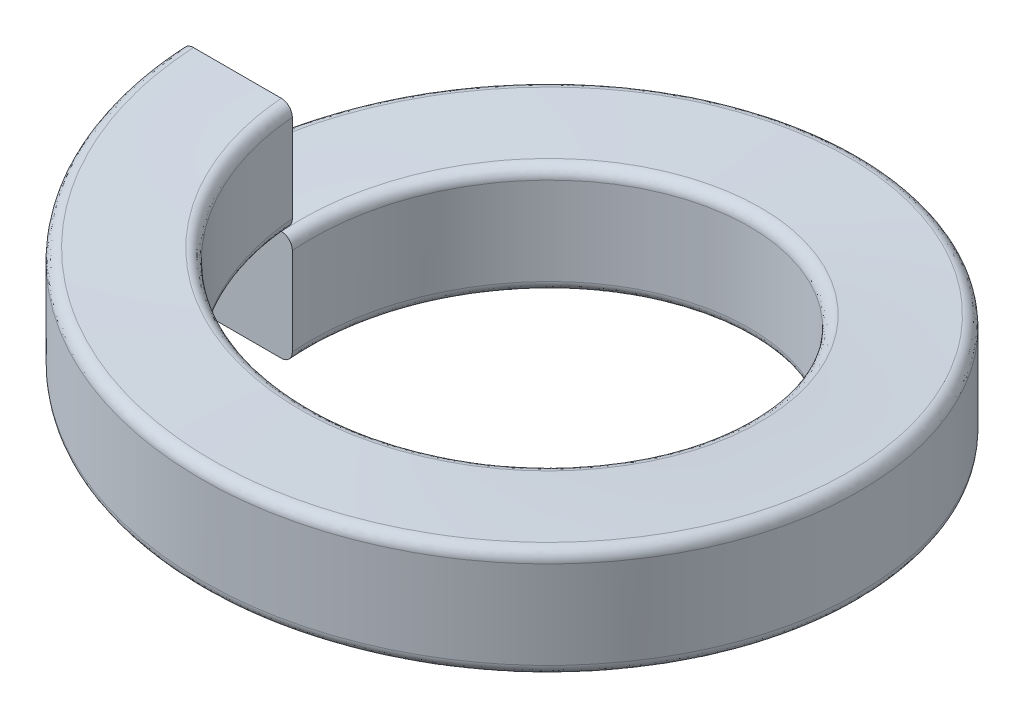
from build123d import *

# Parameters (mm, degrees)
SWEEP_1_PITCH       = 2.1
SWEEP_1_HEIGHT      = 2.1
SWEEP_1_RADIUS      = 5
SWEEP_1_START_ANGLE = -90
SKETCH_6_W          = 2
SKETCH_6_H          = 2
FILLET_1_R          = 0.2


with BuildPart() as part:
    # Sweep 1: sweep along a helix
    with BuildLine() as sweep_1_path:
        add(Helix(SWEEP_1_PITCH, SWEEP_1_HEIGHT, SWEEP_1_RADIUS, center=(0, 0, 0), direction=(0, 1, 0), lefthand=True, mode=Mode.PRIVATE).rotate(Axis((0, 0, 0), (0, 1, 0)), SWEEP_1_START_ANGLE))
    # Sketch 6 → Sweep 1 (sweep)
    with BuildSketch(Plane.XY):
        with Locations((-5, 0)):
            Rectangle(SKETCH_6_W, SKETCH_6_H)
    sweep(path=sweep_1_path.line, is_frenet=True)

    # Fillet 1
    fillet_1_edges = [part.edges().sort_by_distance(p)[0] for p in [
        (3.999995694, 2.05, 0),
        (5.999993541, 2.05, 0),
        (5.99999354, 0.05, 0),
        (3.999995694, 0.05, 0),
    ]]
    fillet(fillet_1_edges, radius=FILLET_1_R)


solid = part.part
